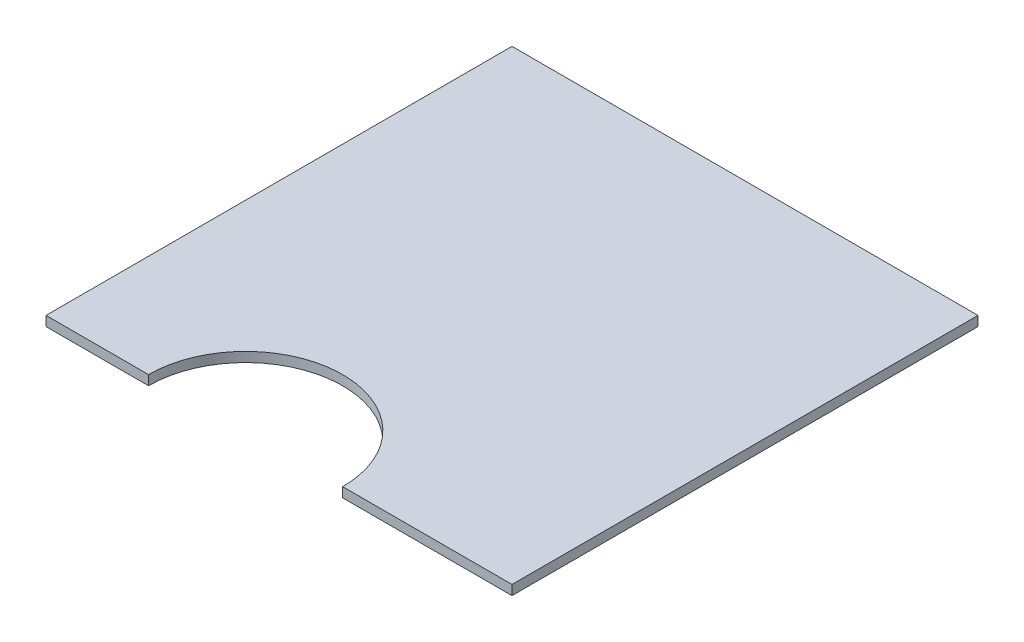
from build123d import *

# Parameters (mm, degrees)
BOSS_EXTRUDE2_DEPTH = 6.35


with BuildPart() as part:
    # Sketch1 → Boss-Extrude2 (new body)
    with BuildSketch(Plane(origin=(0, 0, 0), x_dir=(1, 0, 0), z_dir=(0, 1, 0))):
        with BuildLine():
            Line((-293.845850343, 277.593230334), (-293.845850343, -27.206769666))
            Line((-293.845850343, -27.206769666), (-226.803385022, -27.206769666))
            ThreePointArc((-226.803385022, -27.206769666), (-163.303385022, 36.293230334), (-99.803385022, -27.206769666))
            Line((-99.803385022, -27.206769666), (10.954149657, -27.206769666))
            Line((10.954149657, -27.206769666), (10.954149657, 277.593230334))
            Line((10.954149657, 277.593230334), (-293.845850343, 277.593230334))
        make_face()
    extrude(amount=BOSS_EXTRUDE2_DEPTH)


solid = part.part
